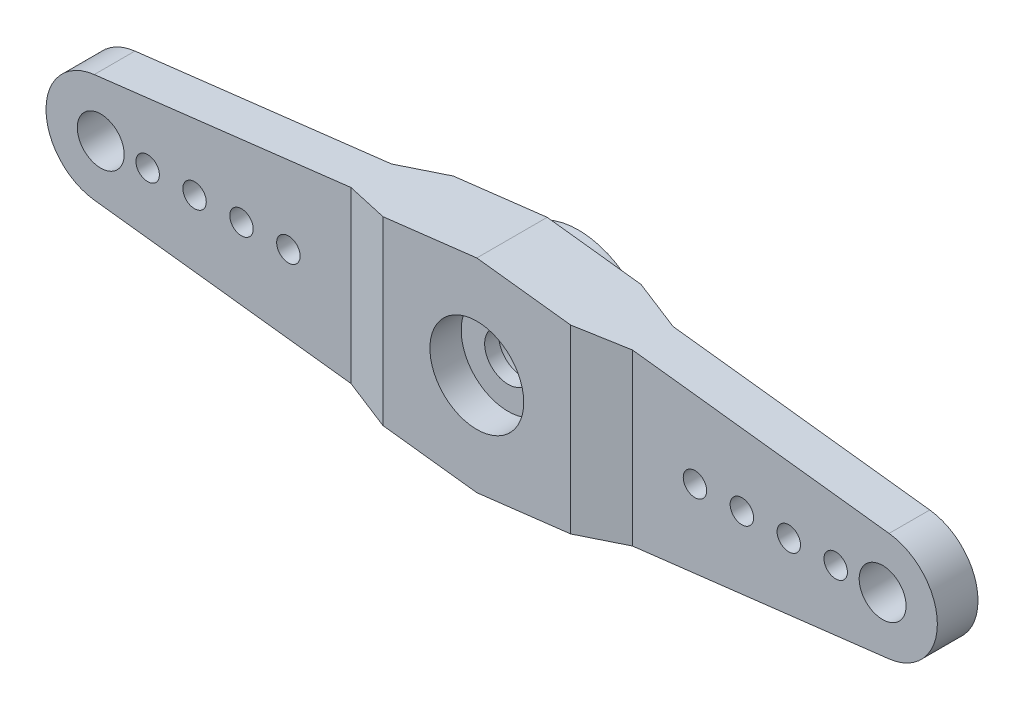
ISO-10303-21;
HEADER;
FILE_DESCRIPTION(('STEP AP214'),'2;1');
FILE_NAME('part.step','',(''),(''),'','','');
FILE_SCHEMA(('AUTOMOTIVE_DESIGN { 1 0 10303 214 1 1 1 1 }'));
ENDSEC;
DATA;
#1=APPLICATION_CONTEXT('core data for automotive mechanical design processes');
#2=APPLICATION_PROTOCOL_DEFINITION('international standard','automotive_design',2000,#1);
#3=PRODUCT_CONTEXT('',#1,'mechanical');
#4=PRODUCT('Part','Part','',(#3));
#5=PRODUCT_RELATED_PRODUCT_CATEGORY('part','',(#4));
#6=PRODUCT_DEFINITION_FORMATION('','',#4);
#7=PRODUCT_DEFINITION_CONTEXT('part definition',#1,'design');
#8=PRODUCT_DEFINITION('design','',#6,#7);
#9=PRODUCT_DEFINITION_SHAPE('','',#8);
#10=(LENGTH_UNIT() NAMED_UNIT(*) SI_UNIT(.MILLI.,.METRE.));
#11=(NAMED_UNIT(*) PLANE_ANGLE_UNIT() SI_UNIT($,.RADIAN.));
#12=(NAMED_UNIT(*) SI_UNIT($,.STERADIAN.) SOLID_ANGLE_UNIT());
#13=UNCERTAINTY_MEASURE_WITH_UNIT(LENGTH_MEASURE(1.E-05),#10,'distance_accuracy_value','');
#14=(GEOMETRIC_REPRESENTATION_CONTEXT(3) GLOBAL_UNCERTAINTY_ASSIGNED_CONTEXT((#13)) GLOBAL_UNIT_ASSIGNED_CONTEXT((#10,
#11,#12)) REPRESENTATION_CONTEXT('',''));
#15=CARTESIAN_POINT('',(0.,0.,0.));
#16=DIRECTION('',(0.,0.,1.));
#17=DIRECTION('',(1.,0.,0.));
#18=AXIS2_PLACEMENT_3D('',#15,#16,#17);
#19=CARTESIAN_POINT('',(0.,0.,6.25));
#20=DIRECTION('',(0.,0.,-1.));
#21=DIRECTION('',(-1.,0.,0.));
#22=AXIS2_PLACEMENT_3D('',#19,#20,#21);
#23=CYLINDRICAL_SURFACE('',#22,1.5);
#24=CARTESIAN_POINT('',(0.,0.,0.65));
#25=DIRECTION('',(0.,0.,-1.));
#26=DIRECTION('',(-1.,0.,0.));
#27=AXIS2_PLACEMENT_3D('',#24,#25,#26);
#28=CIRCLE('',#27,1.5);
#29=CARTESIAN_POINT('',(-1.5,0.,0.65));
#30=VERTEX_POINT('',#29);
#31=EDGE_CURVE('E422',#30,#30,#28,.T.);
#32=ORIENTED_EDGE('',*,*,#31,.T.);
#33=EDGE_LOOP('',(#32));
#34=FACE_BOUND('',#33,.T.);
#35=CARTESIAN_POINT('',(0.,0.,1.55));
#36=DIRECTION('',(0.,0.,1.));
#37=DIRECTION('',(1.,0.,0.));
#38=AXIS2_PLACEMENT_3D('',#35,#36,#37);
#39=CIRCLE('',#38,1.5);
#40=CARTESIAN_POINT('',(1.5,0.,1.55));
#41=VERTEX_POINT('',#40);
#42=EDGE_CURVE('E49',#41,#41,#39,.F.);
#43=ORIENTED_EDGE('',*,*,#42,.F.);
#44=EDGE_LOOP('',(#43));
#45=FACE_BOUND('',#44,.T.);
#46=ADVANCED_FACE('F45',(#34,#45),#23,.F.);
#47=CARTESIAN_POINT('',(0.,6.5,2.6));
#48=DIRECTION('',(-0.118178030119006,-0.992992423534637,0.));
#49=DIRECTION('',(0.992992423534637,-0.118178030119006,0.));
#50=AXIS2_PLACEMENT_3D('',#47,#48,#49);
#51=PLANE('',#50);
#52=DIRECTION('',(-0.947264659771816,0.112735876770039,0.299967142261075));
#53=VECTOR('',#52,1.);
#54=CARTESIAN_POINT('',(0.809822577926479,6.40362138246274,5.1935561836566));
#55=LINE('',#54,#53);
#56=CARTESIAN_POINT('',(8.99999999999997,5.42889185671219,2.6));
#57=VERTEX_POINT('',#56);
#58=CARTESIAN_POINT('',(5.99999999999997,5.78592790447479,3.55));
#59=VERTEX_POINT('',#58);
#60=EDGE_CURVE('E69',#57,#59,#55,.T.);
#61=ORIENTED_EDGE('',*,*,#60,.F.);
#62=DIRECTION('',(-0.992992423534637,0.118178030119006,0.));
#63=VECTOR('',#62,1.);
#64=CARTESIAN_POINT('',(0.,6.5,2.6));
#65=LINE('',#64,#63);
#66=CARTESIAN_POINT('',(25.4136231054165,3.47547348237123,2.6));
#67=VERTEX_POINT('',#66);
#68=EDGE_CURVE('E197',#67,#57,#65,.T.);
#69=ORIENTED_EDGE('',*,*,#68,.F.);
#70=DIRECTION('',(0.,0.,-1.));
#71=VECTOR('',#70,1.);
#72=CARTESIAN_POINT('',(25.4136231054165,3.47547348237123,2.6));
#73=LINE('',#72,#71);
#74=CARTESIAN_POINT('',(25.4136231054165,3.47547348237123,0.));
#75=VERTEX_POINT('',#74);
#76=EDGE_CURVE('E198',#67,#75,#73,.T.);
#77=ORIENTED_EDGE('',*,*,#76,.T.);
#78=DIRECTION('',(-0.992992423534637,0.118178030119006,0.));
#79=VECTOR('',#78,1.);
#80=CARTESIAN_POINT('',(0.,6.5,0.));
#81=LINE('',#80,#79);
#82=CARTESIAN_POINT('',(9.,5.42889185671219,0.));
#83=VERTEX_POINT('',#82);
#84=EDGE_CURVE('E178',#75,#83,#81,.T.);
#85=ORIENTED_EDGE('',*,*,#84,.T.);
#86=DIRECTION('',(0.947264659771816,-0.112735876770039,0.299967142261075));
#87=VECTOR('',#86,1.);
#88=CARTESIAN_POINT('',(1.5486080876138,6.31569702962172,-2.3596074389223));
#89=LINE('',#88,#87);
#90=CARTESIAN_POINT('',(6.,5.78592790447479,-0.95));
#91=VERTEX_POINT('',#90);
#92=EDGE_CURVE('E399',#91,#83,#89,.T.);
#93=ORIENTED_EDGE('',*,*,#92,.F.);
#94=DIRECTION('',(0.992992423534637,-0.118178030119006,0.));
#95=VECTOR('',#94,1.);
#96=CARTESIAN_POINT('',(0.,6.5,-0.95));
#97=LINE('',#96,#95);
#98=CARTESIAN_POINT('',(0.,6.5,-0.95));
#99=VERTEX_POINT('',#98);
#100=EDGE_CURVE('E158',#99,#91,#97,.T.);
#101=ORIENTED_EDGE('',*,*,#100,.F.);
#102=DIRECTION('',(0.,0.,-1.));
#103=VECTOR('',#102,1.);
#104=CARTESIAN_POINT('',(0.,6.5,2.6));
#105=LINE('',#104,#103);
#106=CARTESIAN_POINT('',(0.,6.5,3.55));
#107=VERTEX_POINT('',#106);
#108=EDGE_CURVE('E218',#107,#99,#105,.T.);
#109=ORIENTED_EDGE('',*,*,#108,.F.);
#110=DIRECTION('',(-0.992992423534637,0.118178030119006,0.));
#111=VECTOR('',#110,1.);
#112=CARTESIAN_POINT('',(9.,5.42889185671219,3.55));
#113=LINE('',#112,#111);
#114=EDGE_CURVE('E234',#59,#107,#113,.T.);
#115=ORIENTED_EDGE('',*,*,#114,.F.);
#116=EDGE_LOOP('',(#61,#69,#77,#85,#93,#101,#109,#115));
#117=FACE_BOUND('',#116,.T.);
#118=ADVANCED_FACE('F47',(#117),#51,.F.);
#119=CARTESIAN_POINT('',(0.,6.5,2.6));
#120=DIRECTION('',(0.118178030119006,-0.992992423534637,0.));
#121=DIRECTION('',(0.992992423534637,0.118178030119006,0.));
#122=AXIS2_PLACEMENT_3D('',#119,#120,#121);
#123=PLANE('',#122);
#124=DIRECTION('',(-0.947264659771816,-0.11273587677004,-0.299967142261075));
#125=VECTOR('',#124,1.);
#126=CARTESIAN_POINT('',(-0.809822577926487,6.40362138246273,5.19355618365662));
#127=LINE('',#126,#125);
#128=CARTESIAN_POINT('',(-6.00000000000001,5.78592790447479,3.55));
#129=VERTEX_POINT('',#128);
#130=CARTESIAN_POINT('',(-9.00000000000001,5.42889185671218,2.6));
#131=VERTEX_POINT('',#130);
#132=EDGE_CURVE('E376',#129,#131,#127,.T.);
#133=ORIENTED_EDGE('',*,*,#132,.F.);
#134=DIRECTION('',(-0.992992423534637,-0.118178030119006,0.));
#135=VECTOR('',#134,1.);
#136=CARTESIAN_POINT('',(0.,6.5,3.55));
#137=LINE('',#136,#135);
#138=EDGE_CURVE('E245',#107,#129,#137,.T.);
#139=ORIENTED_EDGE('',*,*,#138,.F.);
#140=ORIENTED_EDGE('',*,*,#108,.T.);
#141=DIRECTION('',(0.992992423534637,0.118178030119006,0.));
#142=VECTOR('',#141,1.);
#143=CARTESIAN_POINT('',(-9.,5.42889185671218,-0.95));
#144=LINE('',#143,#142);
#145=CARTESIAN_POINT('',(-6.,5.78592790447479,-0.95));
#146=VERTEX_POINT('',#145);
#147=EDGE_CURVE('E169',#146,#99,#144,.T.);
#148=ORIENTED_EDGE('',*,*,#147,.F.);
#149=DIRECTION('',(0.947264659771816,0.11273587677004,-0.299967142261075));
#150=VECTOR('',#149,1.);
#151=CARTESIAN_POINT('',(-1.54860808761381,6.31569702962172,-2.3596074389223));
#152=LINE('',#151,#150);
#153=CARTESIAN_POINT('',(-9.,5.42889185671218,0.));
#154=VERTEX_POINT('',#153);
#155=EDGE_CURVE('E149',#154,#146,#152,.T.);
#156=ORIENTED_EDGE('',*,*,#155,.F.);
#157=DIRECTION('',(-0.992992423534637,-0.118178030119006,0.));
#158=VECTOR('',#157,1.);
#159=CARTESIAN_POINT('',(0.,6.5,0.));
#160=LINE('',#159,#158);
#161=CARTESIAN_POINT('',(-25.4136231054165,3.47547348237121,0.));
#162=VERTEX_POINT('',#161);
#163=EDGE_CURVE('E166',#154,#162,#160,.T.);
#164=ORIENTED_EDGE('',*,*,#163,.T.);
#165=DIRECTION('',(0.,0.,-1.));
#166=VECTOR('',#165,1.);
#167=CARTESIAN_POINT('',(-25.4136231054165,3.47547348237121,2.6));
#168=LINE('',#167,#166);
#169=CARTESIAN_POINT('',(-25.4136231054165,3.47547348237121,2.6));
#170=VERTEX_POINT('',#169);
#171=EDGE_CURVE('E215',#170,#162,#168,.T.);
#172=ORIENTED_EDGE('',*,*,#171,.F.);
#173=DIRECTION('',(-0.992992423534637,-0.118178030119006,0.));
#174=VECTOR('',#173,1.);
#175=CARTESIAN_POINT('',(0.,6.5,2.6));
#176=LINE('',#175,#174);
#177=EDGE_CURVE('E343',#131,#170,#176,.T.);
#178=ORIENTED_EDGE('',*,*,#177,.F.);
#179=EDGE_LOOP('',(#133,#139,#140,#148,#156,#164,#172,#178));
#180=FACE_BOUND('',#179,.T.);
#181=ADVANCED_FACE('F164',(#180),#123,.F.);
#182=CARTESIAN_POINT('',(0.,-6.5,2.6));
#183=DIRECTION('',(0.118178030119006,0.992992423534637,0.));
#184=DIRECTION('',(-0.992992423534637,0.118178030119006,0.));
#185=AXIS2_PLACEMENT_3D('',#182,#183,#184);
#186=PLANE('',#185);
#187=DIRECTION('',(0.947264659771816,-0.112735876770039,0.299967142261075));
#188=VECTOR('',#187,1.);
#189=CARTESIAN_POINT('',(-0.809822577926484,-6.40362138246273,5.19355618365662));
#190=LINE('',#189,#188);
#191=CARTESIAN_POINT('',(-9.00000000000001,-5.42889185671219,2.6));
#192=VERTEX_POINT('',#191);
#193=CARTESIAN_POINT('',(-6.00000000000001,-5.78592790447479,3.55));
#194=VERTEX_POINT('',#193);
#195=EDGE_CURVE('E62',#192,#194,#190,.T.);
#196=ORIENTED_EDGE('',*,*,#195,.F.);
#197=DIRECTION('',(0.992992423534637,-0.118178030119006,0.));
#198=VECTOR('',#197,1.);
#199=CARTESIAN_POINT('',(0.,-6.5,2.6));
#200=LINE('',#199,#198);
#201=CARTESIAN_POINT('',(-25.4136231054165,-3.47547348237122,2.6));
#202=VERTEX_POINT('',#201);
#203=EDGE_CURVE('E349',#202,#192,#200,.T.);
#204=ORIENTED_EDGE('',*,*,#203,.F.);
#205=DIRECTION('',(0.,0.,-1.));
#206=VECTOR('',#205,1.);
#207=CARTESIAN_POINT('',(-25.4136231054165,-3.47547348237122,2.6));
#208=LINE('',#207,#206);
#209=CARTESIAN_POINT('',(-25.4136231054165,-3.47547348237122,0.));
#210=VERTEX_POINT('',#209);
#211=EDGE_CURVE('E211',#202,#210,#208,.T.);
#212=ORIENTED_EDGE('',*,*,#211,.T.);
#213=DIRECTION('',(0.992992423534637,-0.118178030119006,0.));
#214=VECTOR('',#213,1.);
#215=CARTESIAN_POINT('',(0.,-6.5,0.));
#216=LINE('',#215,#214);
#217=CARTESIAN_POINT('',(-9.,-5.42889185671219,0.));
#218=VERTEX_POINT('',#217);
#219=EDGE_CURVE('E182',#210,#218,#216,.T.);
#220=ORIENTED_EDGE('',*,*,#219,.T.);
#221=DIRECTION('',(-0.947264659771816,0.112735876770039,0.299967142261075));
#222=VECTOR('',#221,1.);
#223=CARTESIAN_POINT('',(-1.5486080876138,-6.31569702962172,-2.3596074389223));
#224=LINE('',#223,#222);
#225=CARTESIAN_POINT('',(-6.,-5.78592790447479,-0.95));
#226=VERTEX_POINT('',#225);
#227=EDGE_CURVE('E152',#226,#218,#224,.T.);
#228=ORIENTED_EDGE('',*,*,#227,.F.);
#229=DIRECTION('',(-0.992992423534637,0.118178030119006,0.));
#230=VECTOR('',#229,1.);
#231=CARTESIAN_POINT('',(0.,-6.5,-0.95));
#232=LINE('',#231,#230);
#233=CARTESIAN_POINT('',(0.,-6.5,-0.95));
#234=VERTEX_POINT('',#233);
#235=EDGE_CURVE('E382',#234,#226,#232,.T.);
#236=ORIENTED_EDGE('',*,*,#235,.F.);
#237=DIRECTION('',(0.,0.,-1.));
#238=VECTOR('',#237,1.);
#239=CARTESIAN_POINT('',(0.,-6.5,2.6));
#240=LINE('',#239,#238);
#241=CARTESIAN_POINT('',(0.,-6.5,3.55));
#242=VERTEX_POINT('',#241);
#243=EDGE_CURVE('E207',#242,#234,#240,.T.);
#244=ORIENTED_EDGE('',*,*,#243,.F.);
#245=DIRECTION('',(0.992992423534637,-0.118178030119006,0.));
#246=VECTOR('',#245,1.);
#247=CARTESIAN_POINT('',(-9.,-5.42889185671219,3.55));
#248=LINE('',#247,#246);
#249=EDGE_CURVE('E250',#194,#242,#248,.T.);
#250=ORIENTED_EDGE('',*,*,#249,.F.);
#251=EDGE_LOOP('',(#196,#204,#212,#220,#228,#236,#244,#250));
#252=FACE_BOUND('',#251,.T.);
#253=ADVANCED_FACE('F537',(#252),#186,.F.);
#254=CARTESIAN_POINT('',(0.,-6.5,2.6));
#255=DIRECTION('',(-0.118178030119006,0.992992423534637,0.));
#256=DIRECTION('',(-0.992992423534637,-0.118178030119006,0.));
#257=AXIS2_PLACEMENT_3D('',#254,#255,#256);
#258=PLANE('',#257);
#259=DIRECTION('',(0.947264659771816,0.11273587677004,-0.299967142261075));
#260=VECTOR('',#259,1.);
#261=CARTESIAN_POINT('',(0.809822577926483,-6.40362138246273,5.1935561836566));
#262=LINE('',#261,#260);
#263=CARTESIAN_POINT('',(5.99999999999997,-5.78592790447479,3.55));
#264=VERTEX_POINT('',#263);
#265=CARTESIAN_POINT('',(8.99999999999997,-5.42889185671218,2.6));
#266=VERTEX_POINT('',#265);
#267=EDGE_CURVE('E396',#264,#266,#262,.T.);
#268=ORIENTED_EDGE('',*,*,#267,.F.);
#269=DIRECTION('',(0.992992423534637,0.118178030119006,0.));
#270=VECTOR('',#269,1.);
#271=CARTESIAN_POINT('',(0.,-6.5,3.55));
#272=LINE('',#271,#270);
#273=EDGE_CURVE('E237',#242,#264,#272,.T.);
#274=ORIENTED_EDGE('',*,*,#273,.F.);
#275=ORIENTED_EDGE('',*,*,#243,.T.);
#276=DIRECTION('',(-0.992992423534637,-0.118178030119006,0.));
#277=VECTOR('',#276,1.);
#278=CARTESIAN_POINT('',(9.,-5.42889185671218,-0.95));
#279=LINE('',#278,#277);
#280=CARTESIAN_POINT('',(6.,-5.78592790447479,-0.95));
#281=VERTEX_POINT('',#280);
#282=EDGE_CURVE('E386',#281,#234,#279,.T.);
#283=ORIENTED_EDGE('',*,*,#282,.F.);
#284=DIRECTION('',(-0.947264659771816,-0.11273587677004,-0.299967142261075));
#285=VECTOR('',#284,1.);
#286=CARTESIAN_POINT('',(1.5486080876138,-6.31569702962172,-2.35960743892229));
#287=LINE('',#286,#285);
#288=CARTESIAN_POINT('',(9.,-5.42889185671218,0.));
#289=VERTEX_POINT('',#288);
#290=EDGE_CURVE('E171',#289,#281,#287,.T.);
#291=ORIENTED_EDGE('',*,*,#290,.F.);
#292=DIRECTION('',(0.992992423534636,0.118178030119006,0.));
#293=VECTOR('',#292,1.);
#294=CARTESIAN_POINT('',(0.,-6.5,0.));
#295=LINE('',#294,#293);
#296=CARTESIAN_POINT('',(25.4136231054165,-3.47547348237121,0.));
#297=VERTEX_POINT('',#296);
#298=EDGE_CURVE('E191',#289,#297,#295,.T.);
#299=ORIENTED_EDGE('',*,*,#298,.T.);
#300=DIRECTION('',(0.,0.,-1.));
#301=VECTOR('',#300,1.);
#302=CARTESIAN_POINT('',(25.4136231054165,-3.47547348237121,2.6));
#303=LINE('',#302,#301);
#304=CARTESIAN_POINT('',(25.4136231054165,-3.47547348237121,2.6));
#305=VERTEX_POINT('',#304);
#306=EDGE_CURVE('E202',#305,#297,#303,.T.);
#307=ORIENTED_EDGE('',*,*,#306,.F.);
#308=DIRECTION('',(0.992992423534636,0.118178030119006,0.));
#309=VECTOR('',#308,1.);
#310=CARTESIAN_POINT('',(0.,-6.5,2.6));
#311=LINE('',#310,#309);
#312=EDGE_CURVE('E353',#266,#305,#311,.T.);
#313=ORIENTED_EDGE('',*,*,#312,.F.);
#314=EDGE_LOOP('',(#268,#274,#275,#283,#291,#299,#307,#313));
#315=FACE_BOUND('',#314,.T.);
#316=ADVANCED_FACE('F485',(#315),#258,.F.);
#317=CARTESIAN_POINT('',(0.,0.,3.55));
#318=DIRECTION('',(0.,0.,1.));
#319=DIRECTION('',(1.,0.,0.));
#320=AXIS2_PLACEMENT_3D('',#317,#318,#319);
#321=PLANE('',#320);
#322=CARTESIAN_POINT('',(0.,0.,3.55));
#323=DIRECTION('',(0.,0.,1.));
#324=DIRECTION('',(1.,0.,0.));
#325=AXIS2_PLACEMENT_3D('',#322,#323,#324);
#326=CIRCLE('',#325,3.);
#327=CARTESIAN_POINT('',(3.,0.,3.55));
#328=VERTEX_POINT('',#327);
#329=EDGE_CURVE('E426',#328,#328,#326,.T.);
#330=ORIENTED_EDGE('',*,*,#329,.F.);
#331=EDGE_LOOP('',(#330));
#332=FACE_BOUND('',#331,.T.);
#333=ORIENTED_EDGE('',*,*,#138,.T.);
#334=DIRECTION('',(0.,-1.,0.));
#335=VECTOR('',#334,1.);
#336=CARTESIAN_POINT('',(-6.00000000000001,0.,3.55));
#337=LINE('',#336,#335);
#338=EDGE_CURVE('E11',#129,#194,#337,.T.);
#339=ORIENTED_EDGE('',*,*,#338,.T.);
#340=ORIENTED_EDGE('',*,*,#249,.T.);
#341=ORIENTED_EDGE('',*,*,#273,.T.);
#342=DIRECTION('',(0.,1.,0.));
#343=VECTOR('',#342,1.);
#344=CARTESIAN_POINT('',(5.99999999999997,0.,3.55));
#345=LINE('',#344,#343);
#346=EDGE_CURVE('E55',#264,#59,#345,.T.);
#347=ORIENTED_EDGE('',*,*,#346,.T.);
#348=ORIENTED_EDGE('',*,*,#114,.T.);
#349=EDGE_LOOP('',(#333,#339,#340,#341,#347,#348));
#350=FACE_BOUND('',#349,.T.);
#351=ADVANCED_FACE('F233',(#332,#350),#321,.T.);
#352=CARTESIAN_POINT('',(0.,0.,-0.95));
#353=DIRECTION('',(0.,0.,-1.));
#354=DIRECTION('',(-1.,0.,0.));
#355=AXIS2_PLACEMENT_3D('',#352,#353,#354);
#356=PLANE('',#355);
#357=CARTESIAN_POINT('',(0.,0.,-0.95));
#358=DIRECTION('',(0.,0.,-1.));
#359=DIRECTION('',(-1.,0.,0.));
#360=AXIS2_PLACEMENT_3D('',#357,#358,#359);
#361=CIRCLE('',#360,4.8);
#362=CARTESIAN_POINT('',(-4.8,0.,-0.95));
#363=VERTEX_POINT('',#362);
#364=EDGE_CURVE('E407',#363,#363,#361,.T.);
#365=ORIENTED_EDGE('',*,*,#364,.F.);
#366=EDGE_LOOP('',(#365));
#367=FACE_BOUND('',#366,.T.);
#368=ORIENTED_EDGE('',*,*,#100,.T.);
#369=DIRECTION('',(0.,-1.,0.));
#370=VECTOR('',#369,1.);
#371=CARTESIAN_POINT('',(6.,0.,-0.95));
#372=LINE('',#371,#370);
#373=EDGE_CURVE('E224',#91,#281,#372,.T.);
#374=ORIENTED_EDGE('',*,*,#373,.T.);
#375=ORIENTED_EDGE('',*,*,#282,.T.);
#376=ORIENTED_EDGE('',*,*,#235,.T.);
#377=DIRECTION('',(0.,1.,0.));
#378=VECTOR('',#377,1.);
#379=CARTESIAN_POINT('',(-6.,0.,-0.95));
#380=LINE('',#379,#378);
#381=EDGE_CURVE('E221',#226,#146,#380,.T.);
#382=ORIENTED_EDGE('',*,*,#381,.T.);
#383=ORIENTED_EDGE('',*,*,#147,.T.);
#384=EDGE_LOOP('',(#368,#374,#375,#376,#382,#383));
#385=FACE_BOUND('',#384,.T.);
#386=ADVANCED_FACE('F480',(#367,#385),#356,.T.);
#387=CARTESIAN_POINT('',(25.,0.,0.));
#388=DIRECTION('',(0.,0.,-1.));
#389=DIRECTION('',(-1.,0.,0.));
#390=AXIS2_PLACEMENT_3D('',#387,#388,#389);
#391=PLANE('',#390);
#392=DIRECTION('',(0.,1.,0.));
#393=VECTOR('',#392,1.);
#394=CARTESIAN_POINT('',(-9.,-5.42889185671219,0.));
#395=LINE('',#394,#393);
#396=EDGE_CURVE('E146',#218,#154,#395,.T.);
#397=ORIENTED_EDGE('',*,*,#396,.F.);
#398=ORIENTED_EDGE('',*,*,#219,.F.);
#399=CARTESIAN_POINT('',(-25.,0.,0.));
#400=DIRECTION('',(0.,0.,1.));
#401=DIRECTION('',(1.,0.,0.));
#402=AXIS2_PLACEMENT_3D('',#399,#400,#401);
#403=CIRCLE('',#402,3.49999999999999);
#404=EDGE_CURVE('E176',#162,#210,#403,.T.);
#405=ORIENTED_EDGE('',*,*,#404,.F.);
#406=ORIENTED_EDGE('',*,*,#163,.F.);
#407=EDGE_LOOP('',(#397,#398,#405,#406));
#408=FACE_BOUND('',#407,.T.);
#409=CARTESIAN_POINT('',(-16.,0.,0.));
#410=DIRECTION('',(0.,0.,1.));
#411=DIRECTION('',(1.,0.,0.));
#412=AXIS2_PLACEMENT_3D('',#409,#410,#411);
#413=CIRCLE('',#412,0.75);
#414=CARTESIAN_POINT('',(-15.25,0.,0.));
#415=VERTEX_POINT('',#414);
#416=EDGE_CURVE('E307',#415,#415,#413,.T.);
#417=ORIENTED_EDGE('',*,*,#416,.T.);
#418=EDGE_LOOP('',(#417));
#419=FACE_BOUND('',#418,.T.);
#420=CARTESIAN_POINT('',(-22.,0.,0.));
#421=DIRECTION('',(0.,0.,1.));
#422=DIRECTION('',(1.,0.,0.));
#423=AXIS2_PLACEMENT_3D('',#420,#421,#422);
#424=CIRCLE('',#423,0.750000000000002);
#425=CARTESIAN_POINT('',(-21.25,0.,0.));
#426=VERTEX_POINT('',#425);
#427=EDGE_CURVE('E323',#426,#426,#424,.T.);
#428=ORIENTED_EDGE('',*,*,#427,.T.);
#429=EDGE_LOOP('',(#428));
#430=FACE_BOUND('',#429,.T.);
#431=CARTESIAN_POINT('',(-25.,0.,0.));
#432=DIRECTION('',(0.,0.,1.));
#433=DIRECTION('',(1.,0.,0.));
#434=AXIS2_PLACEMENT_3D('',#431,#432,#433);
#435=CIRCLE('',#434,1.5);
#436=CARTESIAN_POINT('',(-23.5,0.,0.));
#437=VERTEX_POINT('',#436);
#438=EDGE_CURVE('E331',#437,#437,#435,.T.);
#439=ORIENTED_EDGE('',*,*,#438,.T.);
#440=EDGE_LOOP('',(#439));
#441=FACE_BOUND('',#440,.T.);
#442=CARTESIAN_POINT('',(-19.,0.,0.));
#443=DIRECTION('',(0.,0.,1.));
#444=DIRECTION('',(1.,0.,0.));
#445=AXIS2_PLACEMENT_3D('',#442,#443,#444);
#446=CIRCLE('',#445,0.750000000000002);
#447=CARTESIAN_POINT('',(-18.25,0.,0.));
#448=VERTEX_POINT('',#447);
#449=EDGE_CURVE('E315',#448,#448,#446,.T.);
#450=ORIENTED_EDGE('',*,*,#449,.T.);
#451=EDGE_LOOP('',(#450));
#452=FACE_BOUND('',#451,.T.);
#453=CARTESIAN_POINT('',(-13.,0.,0.));
#454=DIRECTION('',(0.,0.,1.));
#455=DIRECTION('',(1.,0.,0.));
#456=AXIS2_PLACEMENT_3D('',#453,#454,#455);
#457=CIRCLE('',#456,0.75);
#458=CARTESIAN_POINT('',(-12.25,0.,0.));
#459=VERTEX_POINT('',#458);
#460=EDGE_CURVE('E299',#459,#459,#457,.T.);
#461=ORIENTED_EDGE('',*,*,#460,.T.);
#462=EDGE_LOOP('',(#461));
#463=FACE_BOUND('',#462,.T.);
#464=ADVANCED_FACE('F174',(#408,#419,#430,#441,#452,#463),#391,.T.);
#465=CARTESIAN_POINT('',(25.,0.,2.6));
#466=DIRECTION('',(0.,0.,-1.));
#467=DIRECTION('',(-1.,0.,0.));
#468=AXIS2_PLACEMENT_3D('',#465,#466,#467);
#469=PLANE('',#468);
#470=CARTESIAN_POINT('',(25.,0.,2.6));
#471=DIRECTION('',(0.,0.,1.));
#472=DIRECTION('',(-1.,0.,0.));
#473=AXIS2_PLACEMENT_3D('',#470,#471,#472);
#474=CIRCLE('',#473,1.5);
#475=CARTESIAN_POINT('',(23.5,0.,2.6));
#476=VERTEX_POINT('',#475);
#477=EDGE_CURVE('E263',#476,#476,#474,.T.);
#478=ORIENTED_EDGE('',*,*,#477,.F.);
#479=EDGE_LOOP('',(#478));
#480=FACE_BOUND('',#479,.T.);
#481=CARTESIAN_POINT('',(22.,0.,2.6));
#482=DIRECTION('',(0.,0.,1.));
#483=DIRECTION('',(-1.,0.,0.));
#484=AXIS2_PLACEMENT_3D('',#481,#482,#483);
#485=CIRCLE('',#484,0.750000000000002);
#486=CARTESIAN_POINT('',(21.25,0.,2.6));
#487=VERTEX_POINT('',#486);
#488=EDGE_CURVE('E271',#487,#487,#485,.T.);
#489=ORIENTED_EDGE('',*,*,#488,.F.);
#490=EDGE_LOOP('',(#489));
#491=FACE_BOUND('',#490,.T.);
#492=CARTESIAN_POINT('',(19.,0.,2.6));
#493=DIRECTION('',(0.,0.,1.));
#494=DIRECTION('',(-1.,0.,0.));
#495=AXIS2_PLACEMENT_3D('',#492,#493,#494);
#496=CIRCLE('',#495,0.750000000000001);
#497=CARTESIAN_POINT('',(18.25,0.,2.6));
#498=VERTEX_POINT('',#497);
#499=EDGE_CURVE('E279',#498,#498,#496,.T.);
#500=ORIENTED_EDGE('',*,*,#499,.F.);
#501=EDGE_LOOP('',(#500));
#502=FACE_BOUND('',#501,.T.);
#503=CARTESIAN_POINT('',(16.,0.,2.6));
#504=DIRECTION('',(0.,0.,1.));
#505=DIRECTION('',(-1.,0.,0.));
#506=AXIS2_PLACEMENT_3D('',#503,#504,#505);
#507=CIRCLE('',#506,0.75);
#508=CARTESIAN_POINT('',(15.25,0.,2.6));
#509=VERTEX_POINT('',#508);
#510=EDGE_CURVE('E287',#509,#509,#507,.T.);
#511=ORIENTED_EDGE('',*,*,#510,.F.);
#512=EDGE_LOOP('',(#511));
#513=FACE_BOUND('',#512,.T.);
#514=CARTESIAN_POINT('',(13.,0.,2.6));
#515=DIRECTION('',(0.,0.,1.));
#516=DIRECTION('',(-1.,0.,0.));
#517=AXIS2_PLACEMENT_3D('',#514,#515,#516);
#518=CIRCLE('',#517,0.75);
#519=CARTESIAN_POINT('',(12.25,0.,2.6));
#520=VERTEX_POINT('',#519);
#521=EDGE_CURVE('E295',#520,#520,#518,.T.);
#522=ORIENTED_EDGE('',*,*,#521,.F.);
#523=EDGE_LOOP('',(#522));
#524=FACE_BOUND('',#523,.T.);
#525=DIRECTION('',(0.,1.,0.));
#526=VECTOR('',#525,1.);
#527=CARTESIAN_POINT('',(9.,-5.42889185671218,2.6));
#528=LINE('',#527,#526);
#529=EDGE_CURVE('E246',#266,#57,#528,.T.);
#530=ORIENTED_EDGE('',*,*,#529,.F.);
#531=ORIENTED_EDGE('',*,*,#312,.T.);
#532=CARTESIAN_POINT('',(25.,0.,2.6));
#533=DIRECTION('',(0.,0.,1.));
#534=DIRECTION('',(-1.,0.,0.));
#535=AXIS2_PLACEMENT_3D('',#532,#533,#534);
#536=CIRCLE('',#535,3.49999999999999);
#537=EDGE_CURVE('E203',#305,#67,#536,.T.);
#538=ORIENTED_EDGE('',*,*,#537,.T.);
#539=ORIENTED_EDGE('',*,*,#68,.T.);
#540=EDGE_LOOP('',(#530,#531,#538,#539));
#541=FACE_BOUND('',#540,.T.);
#542=ADVANCED_FACE('F360',(#480,#491,#502,#513,#524,#541),#469,.F.);
#543=CARTESIAN_POINT('',(-13.,0.,2.6));
#544=DIRECTION('',(0.,0.,1.));
#545=DIRECTION('',(1.,0.,0.));
#546=AXIS2_PLACEMENT_3D('',#543,#544,#545);
#547=CIRCLE('',#546,0.75);
#548=CARTESIAN_POINT('',(-12.25,0.,2.6));
#549=VERTEX_POINT('',#548);
#550=EDGE_CURVE('E303',#549,#549,#547,.T.);
#551=ORIENTED_EDGE('',*,*,#550,.F.);
#552=EDGE_LOOP('',(#551));
#553=FACE_BOUND('',#552,.T.);
#554=CARTESIAN_POINT('',(-16.,0.,2.6));
#555=DIRECTION('',(0.,0.,1.));
#556=DIRECTION('',(1.,0.,0.));
#557=AXIS2_PLACEMENT_3D('',#554,#555,#556);
#558=CIRCLE('',#557,0.75);
#559=CARTESIAN_POINT('',(-15.25,0.,2.6));
#560=VERTEX_POINT('',#559);
#561=EDGE_CURVE('E311',#560,#560,#558,.T.);
#562=ORIENTED_EDGE('',*,*,#561,.F.);
#563=EDGE_LOOP('',(#562));
#564=FACE_BOUND('',#563,.T.);
#565=CARTESIAN_POINT('',(-19.,0.,2.6));
#566=DIRECTION('',(0.,0.,1.));
#567=DIRECTION('',(1.,0.,0.));
#568=AXIS2_PLACEMENT_3D('',#565,#566,#567);
#569=CIRCLE('',#568,0.750000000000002);
#570=CARTESIAN_POINT('',(-18.25,0.,2.6));
#571=VERTEX_POINT('',#570);
#572=EDGE_CURVE('E319',#571,#571,#569,.T.);
#573=ORIENTED_EDGE('',*,*,#572,.F.);
#574=EDGE_LOOP('',(#573));
#575=FACE_BOUND('',#574,.T.);
#576=CARTESIAN_POINT('',(-22.,0.,2.6));
#577=DIRECTION('',(0.,0.,1.));
#578=DIRECTION('',(1.,0.,0.));
#579=AXIS2_PLACEMENT_3D('',#576,#577,#578);
#580=CIRCLE('',#579,0.750000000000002);
#581=CARTESIAN_POINT('',(-21.25,0.,2.6));
#582=VERTEX_POINT('',#581);
#583=EDGE_CURVE('E327',#582,#582,#580,.T.);
#584=ORIENTED_EDGE('',*,*,#583,.F.);
#585=EDGE_LOOP('',(#584));
#586=FACE_BOUND('',#585,.T.);
#587=CARTESIAN_POINT('',(-25.,0.,2.6));
#588=DIRECTION('',(0.,0.,1.));
#589=DIRECTION('',(1.,0.,0.));
#590=AXIS2_PLACEMENT_3D('',#587,#588,#589);
#591=CIRCLE('',#590,1.5);
#592=CARTESIAN_POINT('',(-23.5,0.,2.6));
#593=VERTEX_POINT('',#592);
#594=EDGE_CURVE('E185',#593,#593,#591,.T.);
#595=ORIENTED_EDGE('',*,*,#594,.F.);
#596=EDGE_LOOP('',(#595));
#597=FACE_BOUND('',#596,.T.);
#598=DIRECTION('',(0.,-1.,0.));
#599=VECTOR('',#598,1.);
#600=CARTESIAN_POINT('',(-9.,5.42889185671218,2.6));
#601=LINE('',#600,#599);
#602=EDGE_CURVE('E252',#131,#192,#601,.T.);
#603=ORIENTED_EDGE('',*,*,#602,.F.);
#604=ORIENTED_EDGE('',*,*,#177,.T.);
#605=CARTESIAN_POINT('',(-25.,0.,2.6));
#606=DIRECTION('',(0.,0.,1.));
#607=DIRECTION('',(1.,0.,0.));
#608=AXIS2_PLACEMENT_3D('',#605,#606,#607);
#609=CIRCLE('',#608,3.49999999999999);
#610=EDGE_CURVE('E346',#170,#202,#609,.T.);
#611=ORIENTED_EDGE('',*,*,#610,.T.);
#612=ORIENTED_EDGE('',*,*,#203,.T.);
#613=EDGE_LOOP('',(#603,#604,#611,#612));
#614=FACE_BOUND('',#613,.T.);
#615=ADVANCED_FACE('F528',(#553,#564,#575,#586,#597,#614),#469,.F.);
#616=DIRECTION('',(0.,-1.,0.));
#617=VECTOR('',#616,1.);
#618=CARTESIAN_POINT('',(9.,5.42889185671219,0.));
#619=LINE('',#618,#617);
#620=EDGE_CURVE('E159',#83,#289,#619,.T.);
#621=ORIENTED_EDGE('',*,*,#620,.F.);
#622=ORIENTED_EDGE('',*,*,#84,.F.);
#623=CARTESIAN_POINT('',(25.,0.,0.));
#624=DIRECTION('',(0.,0.,1.));
#625=DIRECTION('',(-1.,0.,0.));
#626=AXIS2_PLACEMENT_3D('',#623,#624,#625);
#627=CIRCLE('',#626,3.49999999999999);
#628=EDGE_CURVE('E194',#297,#75,#627,.T.);
#629=ORIENTED_EDGE('',*,*,#628,.F.);
#630=ORIENTED_EDGE('',*,*,#298,.F.);
#631=EDGE_LOOP('',(#621,#622,#629,#630));
#632=FACE_BOUND('',#631,.T.);
#633=CARTESIAN_POINT('',(22.,0.,0.));
#634=DIRECTION('',(0.,0.,1.));
#635=DIRECTION('',(-1.,0.,0.));
#636=AXIS2_PLACEMENT_3D('',#633,#634,#635);
#637=CIRCLE('',#636,0.750000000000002);
#638=CARTESIAN_POINT('',(21.25,0.,0.));
#639=VERTEX_POINT('',#638);
#640=EDGE_CURVE('E267',#639,#639,#637,.T.);
#641=ORIENTED_EDGE('',*,*,#640,.T.);
#642=EDGE_LOOP('',(#641));
#643=FACE_BOUND('',#642,.T.);
#644=CARTESIAN_POINT('',(16.,0.,0.));
#645=DIRECTION('',(0.,0.,1.));
#646=DIRECTION('',(-1.,0.,0.));
#647=AXIS2_PLACEMENT_3D('',#644,#645,#646);
#648=CIRCLE('',#647,0.75);
#649=CARTESIAN_POINT('',(15.25,0.,0.));
#650=VERTEX_POINT('',#649);
#651=EDGE_CURVE('E283',#650,#650,#648,.T.);
#652=ORIENTED_EDGE('',*,*,#651,.T.);
#653=EDGE_LOOP('',(#652));
#654=FACE_BOUND('',#653,.T.);
#655=CARTESIAN_POINT('',(13.,0.,0.));
#656=DIRECTION('',(0.,0.,1.));
#657=DIRECTION('',(-1.,0.,0.));
#658=AXIS2_PLACEMENT_3D('',#655,#656,#657);
#659=CIRCLE('',#658,0.75);
#660=CARTESIAN_POINT('',(12.25,0.,0.));
#661=VERTEX_POINT('',#660);
#662=EDGE_CURVE('E291',#661,#661,#659,.T.);
#663=ORIENTED_EDGE('',*,*,#662,.T.);
#664=EDGE_LOOP('',(#663));
#665=FACE_BOUND('',#664,.T.);
#666=CARTESIAN_POINT('',(19.,0.,0.));
#667=DIRECTION('',(0.,0.,1.));
#668=DIRECTION('',(-1.,0.,0.));
#669=AXIS2_PLACEMENT_3D('',#666,#667,#668);
#670=CIRCLE('',#669,0.750000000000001);
#671=CARTESIAN_POINT('',(18.25,0.,0.));
#672=VERTEX_POINT('',#671);
#673=EDGE_CURVE('E275',#672,#672,#670,.T.);
#674=ORIENTED_EDGE('',*,*,#673,.T.);
#675=EDGE_LOOP('',(#674));
#676=FACE_BOUND('',#675,.T.);
#677=CARTESIAN_POINT('',(25.,0.,0.));
#678=DIRECTION('',(0.,0.,1.));
#679=DIRECTION('',(-1.,0.,0.));
#680=AXIS2_PLACEMENT_3D('',#677,#678,#679);
#681=CIRCLE('',#680,1.5);
#682=CARTESIAN_POINT('',(23.5,0.,0.));
#683=VERTEX_POINT('',#682);
#684=EDGE_CURVE('E260',#683,#683,#681,.T.);
#685=ORIENTED_EDGE('',*,*,#684,.T.);
#686=EDGE_LOOP('',(#685));
#687=FACE_BOUND('',#686,.T.);
#688=ADVANCED_FACE('F370',(#632,#643,#654,#665,#676,#687),#391,.T.);
#689=CARTESIAN_POINT('',(-25.,0.,2.6));
#690=DIRECTION('',(0.,0.,-1.));
#691=DIRECTION('',(-1.,0.,0.));
#692=AXIS2_PLACEMENT_3D('',#689,#690,#691);
#693=CYLINDRICAL_SURFACE('',#692,3.49999999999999);
#694=ORIENTED_EDGE('',*,*,#404,.T.);
#695=ORIENTED_EDGE('',*,*,#211,.F.);
#696=ORIENTED_EDGE('',*,*,#610,.F.);
#697=ORIENTED_EDGE('',*,*,#171,.T.);
#698=EDGE_LOOP('',(#694,#695,#696,#697));
#699=FACE_BOUND('',#698,.T.);
#700=ADVANCED_FACE('F532',(#699),#693,.T.);
#701=CARTESIAN_POINT('',(25.,0.,2.6));
#702=DIRECTION('',(0.,0.,-1.));
#703=DIRECTION('',(-1.,0.,0.));
#704=AXIS2_PLACEMENT_3D('',#701,#702,#703);
#705=CYLINDRICAL_SURFACE('',#704,3.49999999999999);
#706=ORIENTED_EDGE('',*,*,#628,.T.);
#707=ORIENTED_EDGE('',*,*,#76,.F.);
#708=ORIENTED_EDGE('',*,*,#537,.F.);
#709=ORIENTED_EDGE('',*,*,#306,.T.);
#710=EDGE_LOOP('',(#706,#707,#708,#709));
#711=FACE_BOUND('',#710,.T.);
#712=ADVANCED_FACE('F364',(#711),#705,.T.);
#713=CARTESIAN_POINT('',(-25.,0.,2.6));
#714=DIRECTION('',(0.,0.,-1.));
#715=DIRECTION('',(-1.,0.,0.));
#716=AXIS2_PLACEMENT_3D('',#713,#714,#715);
#717=CYLINDRICAL_SURFACE('',#716,1.5);
#718=ORIENTED_EDGE('',*,*,#594,.T.);
#719=EDGE_LOOP('',(#718));
#720=FACE_BOUND('',#719,.T.);
#721=ORIENTED_EDGE('',*,*,#438,.F.);
#722=EDGE_LOOP('',(#721));
#723=FACE_BOUND('',#722,.T.);
#724=ADVANCED_FACE('F521',(#720,#723),#717,.F.);
#725=CARTESIAN_POINT('',(-22.,0.,2.6));
#726=DIRECTION('',(0.,0.,-1.));
#727=DIRECTION('',(-1.,0.,0.));
#728=AXIS2_PLACEMENT_3D('',#725,#726,#727);
#729=CYLINDRICAL_SURFACE('',#728,0.750000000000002);
#730=ORIENTED_EDGE('',*,*,#583,.T.);
#731=EDGE_LOOP('',(#730));
#732=FACE_BOUND('',#731,.T.);
#733=ORIENTED_EDGE('',*,*,#427,.F.);
#734=EDGE_LOOP('',(#733));
#735=FACE_BOUND('',#734,.T.);
#736=ADVANCED_FACE('F517',(#732,#735),#729,.F.);
#737=CARTESIAN_POINT('',(-19.,0.,2.6));
#738=DIRECTION('',(0.,0.,-1.));
#739=DIRECTION('',(-1.,0.,0.));
#740=AXIS2_PLACEMENT_3D('',#737,#738,#739);
#741=CYLINDRICAL_SURFACE('',#740,0.750000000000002);
#742=ORIENTED_EDGE('',*,*,#572,.T.);
#743=EDGE_LOOP('',(#742));
#744=FACE_BOUND('',#743,.T.);
#745=ORIENTED_EDGE('',*,*,#449,.F.);
#746=EDGE_LOOP('',(#745));
#747=FACE_BOUND('',#746,.T.);
#748=ADVANCED_FACE('F513',(#744,#747),#741,.F.);
#749=CARTESIAN_POINT('',(-16.,0.,2.6));
#750=DIRECTION('',(0.,0.,-1.));
#751=DIRECTION('',(-1.,0.,0.));
#752=AXIS2_PLACEMENT_3D('',#749,#750,#751);
#753=CYLINDRICAL_SURFACE('',#752,0.75);
#754=ORIENTED_EDGE('',*,*,#561,.T.);
#755=EDGE_LOOP('',(#754));
#756=FACE_BOUND('',#755,.T.);
#757=ORIENTED_EDGE('',*,*,#416,.F.);
#758=EDGE_LOOP('',(#757));
#759=FACE_BOUND('',#758,.T.);
#760=ADVANCED_FACE('F509',(#756,#759),#753,.F.);
#761=CARTESIAN_POINT('',(-13.,0.,2.6));
#762=DIRECTION('',(0.,0.,-1.));
#763=DIRECTION('',(-1.,0.,0.));
#764=AXIS2_PLACEMENT_3D('',#761,#762,#763);
#765=CYLINDRICAL_SURFACE('',#764,0.75);
#766=ORIENTED_EDGE('',*,*,#550,.T.);
#767=EDGE_LOOP('',(#766));
#768=FACE_BOUND('',#767,.T.);
#769=ORIENTED_EDGE('',*,*,#460,.F.);
#770=EDGE_LOOP('',(#769));
#771=FACE_BOUND('',#770,.T.);
#772=ADVANCED_FACE('F505',(#768,#771),#765,.F.);
#773=CARTESIAN_POINT('',(13.,0.,2.6));
#774=DIRECTION('',(0.,0.,-1.));
#775=DIRECTION('',(-1.,0.,0.));
#776=AXIS2_PLACEMENT_3D('',#773,#774,#775);
#777=CYLINDRICAL_SURFACE('',#776,0.75);
#778=ORIENTED_EDGE('',*,*,#521,.T.);
#779=EDGE_LOOP('',(#778));
#780=FACE_BOUND('',#779,.T.);
#781=ORIENTED_EDGE('',*,*,#662,.F.);
#782=EDGE_LOOP('',(#781));
#783=FACE_BOUND('',#782,.T.);
#784=ADVANCED_FACE('F501',(#780,#783),#777,.F.);
#785=CARTESIAN_POINT('',(16.,0.,2.6));
#786=DIRECTION('',(0.,0.,-1.));
#787=DIRECTION('',(-1.,0.,0.));
#788=AXIS2_PLACEMENT_3D('',#785,#786,#787);
#789=CYLINDRICAL_SURFACE('',#788,0.75);
#790=ORIENTED_EDGE('',*,*,#510,.T.);
#791=EDGE_LOOP('',(#790));
#792=FACE_BOUND('',#791,.T.);
#793=ORIENTED_EDGE('',*,*,#651,.F.);
#794=EDGE_LOOP('',(#793));
#795=FACE_BOUND('',#794,.T.);
#796=ADVANCED_FACE('F497',(#792,#795),#789,.F.);
#797=CARTESIAN_POINT('',(19.,0.,2.6));
#798=DIRECTION('',(0.,0.,-1.));
#799=DIRECTION('',(-1.,0.,0.));
#800=AXIS2_PLACEMENT_3D('',#797,#798,#799);
#801=CYLINDRICAL_SURFACE('',#800,0.750000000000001);
#802=ORIENTED_EDGE('',*,*,#499,.T.);
#803=EDGE_LOOP('',(#802));
#804=FACE_BOUND('',#803,.T.);
#805=ORIENTED_EDGE('',*,*,#673,.F.);
#806=EDGE_LOOP('',(#805));
#807=FACE_BOUND('',#806,.T.);
#808=ADVANCED_FACE('F493',(#804,#807),#801,.F.);
#809=CARTESIAN_POINT('',(22.,0.,2.6));
#810=DIRECTION('',(0.,0.,-1.));
#811=DIRECTION('',(-1.,0.,0.));
#812=AXIS2_PLACEMENT_3D('',#809,#810,#811);
#813=CYLINDRICAL_SURFACE('',#812,0.750000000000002);
#814=ORIENTED_EDGE('',*,*,#488,.T.);
#815=EDGE_LOOP('',(#814));
#816=FACE_BOUND('',#815,.T.);
#817=ORIENTED_EDGE('',*,*,#640,.F.);
#818=EDGE_LOOP('',(#817));
#819=FACE_BOUND('',#818,.T.);
#820=ADVANCED_FACE('F489',(#816,#819),#813,.F.);
#821=CARTESIAN_POINT('',(25.,0.,2.6));
#822=DIRECTION('',(0.,0.,-1.));
#823=DIRECTION('',(-1.,0.,0.));
#824=AXIS2_PLACEMENT_3D('',#821,#822,#823);
#825=CYLINDRICAL_SURFACE('',#824,1.5);
#826=ORIENTED_EDGE('',*,*,#477,.T.);
#827=EDGE_LOOP('',(#826));
#828=FACE_BOUND('',#827,.T.);
#829=ORIENTED_EDGE('',*,*,#684,.F.);
#830=EDGE_LOOP('',(#829));
#831=FACE_BOUND('',#830,.T.);
#832=ADVANCED_FACE('F479',(#828,#831),#825,.F.);
#833=CARTESIAN_POINT('',(-9.,10.,0.));
#834=DIRECTION('',(-0.301891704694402,0.,-0.953342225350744));
#835=DIRECTION('',(-0.953342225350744,0.,0.301891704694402));
#836=AXIS2_PLACEMENT_3D('',#833,#834,#835);
#837=PLANE('',#836);
#838=ORIENTED_EDGE('',*,*,#155,.T.);
#839=ORIENTED_EDGE('',*,*,#381,.F.);
#840=ORIENTED_EDGE('',*,*,#227,.T.);
#841=ORIENTED_EDGE('',*,*,#396,.T.);
#842=EDGE_LOOP('',(#838,#839,#840,#841));
#843=FACE_BOUND('',#842,.T.);
#844=ADVANCED_FACE('F148',(#843),#837,.T.);
#845=CARTESIAN_POINT('',(6.,10.,-0.95));
#846=DIRECTION('',(0.301891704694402,0.,-0.953342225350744));
#847=DIRECTION('',(-0.953342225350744,0.,-0.301891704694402));
#848=AXIS2_PLACEMENT_3D('',#845,#846,#847);
#849=PLANE('',#848);
#850=ORIENTED_EDGE('',*,*,#92,.T.);
#851=ORIENTED_EDGE('',*,*,#620,.T.);
#852=ORIENTED_EDGE('',*,*,#290,.T.);
#853=ORIENTED_EDGE('',*,*,#373,.F.);
#854=EDGE_LOOP('',(#850,#851,#852,#853));
#855=FACE_BOUND('',#854,.T.);
#856=ADVANCED_FACE('F469',(#855),#849,.T.);
#857=CARTESIAN_POINT('',(5.99999999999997,10.,3.55));
#858=DIRECTION('',(0.301891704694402,0.,0.953342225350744));
#859=DIRECTION('',(0.953342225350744,0.,-0.301891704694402));
#860=AXIS2_PLACEMENT_3D('',#857,#858,#859);
#861=PLANE('',#860);
#862=ORIENTED_EDGE('',*,*,#60,.T.);
#863=ORIENTED_EDGE('',*,*,#346,.F.);
#864=ORIENTED_EDGE('',*,*,#267,.T.);
#865=ORIENTED_EDGE('',*,*,#529,.T.);
#866=EDGE_LOOP('',(#862,#863,#864,#865));
#867=FACE_BOUND('',#866,.T.);
#868=ADVANCED_FACE('F472',(#867),#861,.T.);
#869=CARTESIAN_POINT('',(-9.00000000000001,10.,2.6));
#870=DIRECTION('',(-0.301891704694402,0.,0.953342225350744));
#871=DIRECTION('',(0.953342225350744,0.,0.301891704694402));
#872=AXIS2_PLACEMENT_3D('',#869,#870,#871);
#873=PLANE('',#872);
#874=ORIENTED_EDGE('',*,*,#132,.T.);
#875=ORIENTED_EDGE('',*,*,#602,.T.);
#876=ORIENTED_EDGE('',*,*,#195,.T.);
#877=ORIENTED_EDGE('',*,*,#338,.F.);
#878=EDGE_LOOP('',(#874,#875,#876,#877));
#879=FACE_BOUND('',#878,.T.);
#880=ADVANCED_FACE('F464',(#879),#873,.T.);
#881=CARTESIAN_POINT('',(0.,0.,-2.95));
#882=DIRECTION('',(0.,0.,-1.));
#883=DIRECTION('',(-1.,0.,0.));
#884=AXIS2_PLACEMENT_3D('',#881,#882,#883);
#885=PLANE('',#884);
#886=CARTESIAN_POINT('',(0.,0.,-2.95));
#887=DIRECTION('',(0.,0.,-1.));
#888=DIRECTION('',(-1.,0.,0.));
#889=AXIS2_PLACEMENT_3D('',#886,#887,#888);
#890=CIRCLE('',#889,4.8);
#891=CARTESIAN_POINT('',(-4.8,0.,-2.95));
#892=VERTEX_POINT('',#891);
#893=EDGE_CURVE('E406',#892,#892,#890,.T.);
#894=ORIENTED_EDGE('',*,*,#893,.T.);
#895=EDGE_LOOP('',(#894));
#896=FACE_BOUND('',#895,.T.);
#897=CARTESIAN_POINT('',(0.,0.,-2.95));
#898=DIRECTION('',(0.,0.,-1.));
#899=DIRECTION('',(-1.,0.,0.));
#900=AXIS2_PLACEMENT_3D('',#897,#898,#899);
#901=CIRCLE('',#900,3.);
#902=CARTESIAN_POINT('',(-3.,0.,-2.95));
#903=VERTEX_POINT('',#902);
#904=EDGE_CURVE('E411',#903,#903,#901,.T.);
#905=ORIENTED_EDGE('',*,*,#904,.F.);
#906=EDGE_LOOP('',(#905));
#907=FACE_BOUND('',#906,.T.);
#908=ADVANCED_FACE('F461',(#896,#907),#885,.T.);
#909=CARTESIAN_POINT('',(0.,0.,-2.95));
#910=DIRECTION('',(0.,0.,1.));
#911=DIRECTION('',(1.,0.,0.));
#912=AXIS2_PLACEMENT_3D('',#909,#910,#911);
#913=CYLINDRICAL_SURFACE('',#912,4.8);
#914=ORIENTED_EDGE('',*,*,#893,.F.);
#915=EDGE_LOOP('',(#914));
#916=FACE_BOUND('',#915,.T.);
#917=ORIENTED_EDGE('',*,*,#364,.T.);
#918=EDGE_LOOP('',(#917));
#919=FACE_BOUND('',#918,.T.);
#920=ADVANCED_FACE('F459',(#916,#919),#913,.T.);
#921=CARTESIAN_POINT('',(0.,0.,-2.95));
#922=DIRECTION('',(0.,0.,1.));
#923=DIRECTION('',(1.,0.,0.));
#924=AXIS2_PLACEMENT_3D('',#921,#922,#923);
#925=CYLINDRICAL_SURFACE('',#924,3.);
#926=ORIENTED_EDGE('',*,*,#904,.T.);
#927=EDGE_LOOP('',(#926));
#928=FACE_BOUND('',#927,.T.);
#929=CARTESIAN_POINT('',(0.,0.,0.65));
#930=DIRECTION('',(0.,0.,-1.));
#931=DIRECTION('',(-1.,0.,0.));
#932=AXIS2_PLACEMENT_3D('',#929,#930,#931);
#933=CIRCLE('',#932,3.);
#934=CARTESIAN_POINT('',(-3.,0.,0.65));
#935=VERTEX_POINT('',#934);
#936=EDGE_CURVE('E418',#935,#935,#933,.T.);
#937=ORIENTED_EDGE('',*,*,#936,.F.);
#938=EDGE_LOOP('',(#937));
#939=FACE_BOUND('',#938,.T.);
#940=ADVANCED_FACE('F455',(#928,#939),#925,.F.);
#941=CARTESIAN_POINT('',(0.,0.,0.65));
#942=DIRECTION('',(0.,0.,-1.));
#943=DIRECTION('',(-1.,0.,0.));
#944=AXIS2_PLACEMENT_3D('',#941,#942,#943);
#945=PLANE('',#944);
#946=ORIENTED_EDGE('',*,*,#31,.F.);
#947=EDGE_LOOP('',(#946));
#948=FACE_BOUND('',#947,.T.);
#949=ORIENTED_EDGE('',*,*,#936,.T.);
#950=EDGE_LOOP('',(#949));
#951=FACE_BOUND('',#950,.T.);
#952=ADVANCED_FACE('F453',(#948,#951),#945,.T.);
#953=CARTESIAN_POINT('',(0.,0.,1.55));
#954=DIRECTION('',(0.,0.,1.));
#955=DIRECTION('',(1.,0.,0.));
#956=AXIS2_PLACEMENT_3D('',#953,#954,#955);
#957=PLANE('',#956);
#958=CARTESIAN_POINT('',(0.,0.,1.55));
#959=DIRECTION('',(0.,0.,1.));
#960=DIRECTION('',(1.,0.,0.));
#961=AXIS2_PLACEMENT_3D('',#958,#959,#960);
#962=CIRCLE('',#961,3.);
#963=CARTESIAN_POINT('',(3.,0.,1.55));
#964=VERTEX_POINT('',#963);
#965=EDGE_CURVE('E430',#964,#964,#962,.T.);
#966=ORIENTED_EDGE('',*,*,#965,.T.);
#967=EDGE_LOOP('',(#966));
#968=FACE_BOUND('',#967,.T.);
#969=ORIENTED_EDGE('',*,*,#42,.T.);
#970=EDGE_LOOP('',(#969));
#971=FACE_BOUND('',#970,.T.);
#972=ADVANCED_FACE('F439',(#968,#971),#957,.T.);
#973=CARTESIAN_POINT('',(0.,0.,1.55));
#974=DIRECTION('',(0.,0.,1.));
#975=DIRECTION('',(1.,0.,0.));
#976=AXIS2_PLACEMENT_3D('',#973,#974,#975);
#977=CYLINDRICAL_SURFACE('',#976,3.);
#978=ORIENTED_EDGE('',*,*,#965,.F.);
#979=EDGE_LOOP('',(#978));
#980=FACE_BOUND('',#979,.T.);
#981=ORIENTED_EDGE('',*,*,#329,.T.);
#982=EDGE_LOOP('',(#981));
#983=FACE_BOUND('',#982,.T.);
#984=ADVANCED_FACE('F451',(#980,#983),#977,.F.);
#985=CLOSED_SHELL('',(#46,#118,#181,#253,#316,#351,#386,#464,#542,#615,#688,#700,#712,#724,#736,
#748,#760,#772,#784,#796,#808,#820,#832,#844,#856,#868,#880,#908,#920,#940,#952,#972,#984));
#986=MANIFOLD_SOLID_BREP('B2',#985);
#987=ADVANCED_BREP_SHAPE_REPRESENTATION('',(#18,#986),#14);
#988=SHAPE_DEFINITION_REPRESENTATION(#9,#987);
ENDSEC;
END-ISO-10303-21;
